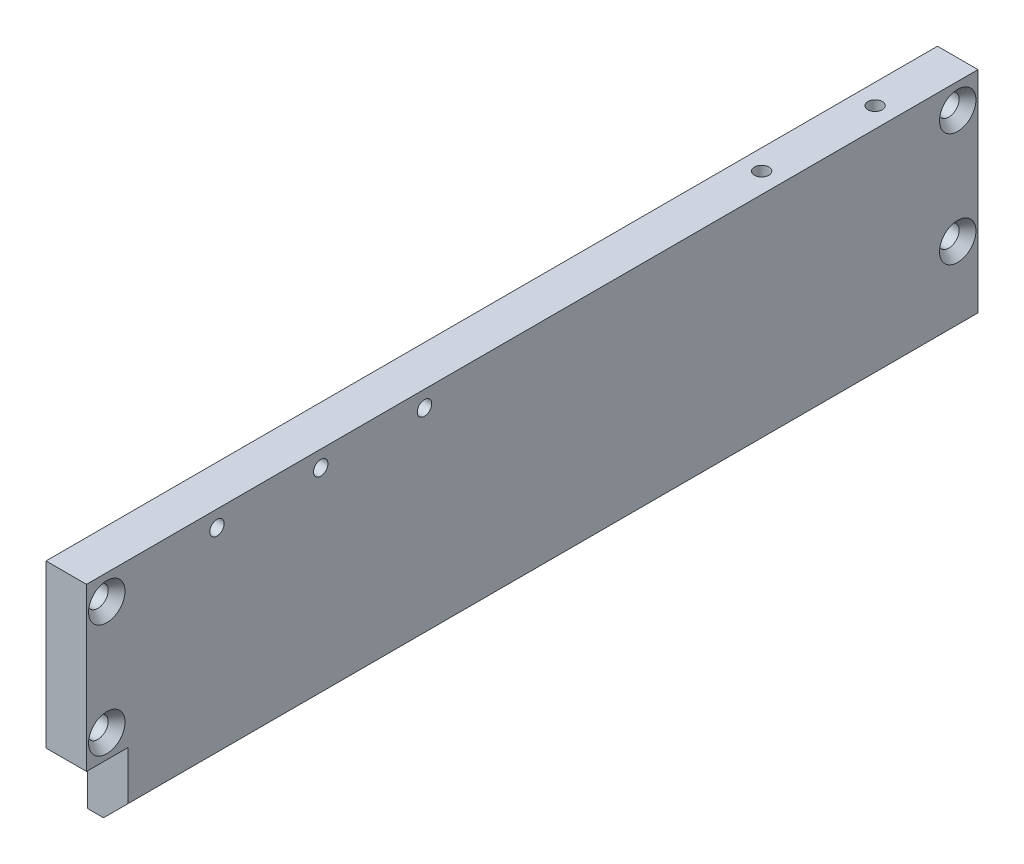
from build123d import *

# Parameters (mm, degrees)
SKETCH1_W                                      = 139.7
SKETCH1_H                                      = 36.83
EXTRUDE1_DEPTH                                 = 6.35
CSK_FOR_4_FLAT_HEAD_MACHINE_SCREW1_D           = 3.2639
CSK_FOR_4_FLAT_HEAD_MACHINE_SCREW1_CSINK_D     = 5.715
CSK_FOR_4_FLAT_HEAD_MACHINE_SCREW1_CSINK_ANGLE = 82
F_4_40_TAPPED_HOLE1_D                          = 2.2606
F_4_40_TAPPED_HOLE1_DEPTH                      = 11.43
F_4_40_TAPPED_HOLE1_TIP                        = 0.679152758
F_4_40_TAPPED_HOLE1_ON_FACE_2_D                = 2.2606
F_4_40_TAPPED_HOLE1_ON_FACE_2_DEPTH            = 11.43
F_4_40_TAPPED_HOLE1_ON_FACE_2_TIP              = 0.679152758
SKETCH6_W                                      = 6.477
SKETCH6_H                                      = 11.43
EXTRUDE2_DEPTH                                 = 76.037549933
CHAMFER1_SIZE                                  = 3.81
F_4_40_TAPPED_HOLE3_D                          = 2.2606


with BuildPart() as part:
    # Sketch1 → Extrude1 (new body)
    with BuildSketch(Plane(origin=(0, 0, 0), x_dir=(0, 0, -1), z_dir=(1, 0, 0))):
        with Locations((0, 8.255)):
            Rectangle(SKETCH1_W, SKETCH1_H)
    extrude(amount=EXTRUDE1_DEPTH)

    # CSK for _4 Flat Head Machine Screw1 (through all)
    with Locations(Plane(origin=(6.35, 22.733, 66.675), x_dir=(0, 0, 1), z_dir=(1, 0, 0))):
        with Locations((0, 0), (0, 17.78), (-133.35, 0), (-133.35, 17.78)):
            CounterSinkHole(CSK_FOR_4_FLAT_HEAD_MACHINE_SCREW1_D / 2, CSK_FOR_4_FLAT_HEAD_MACHINE_SCREW1_CSINK_D / 2, counter_sink_angle=CSK_FOR_4_FLAT_HEAD_MACHINE_SCREW1_CSINK_ANGLE)

    # 4-40 Tapped Hole1
    with Locations(Plane(origin=(3.175, 26.67, -39.116), x_dir=(0, 0, 1), z_dir=(0, 1, 0))):
        with Locations((0, 0), (-17.78, 0)):
            Hole(F_4_40_TAPPED_HOLE1_D / 2, depth=F_4_40_TAPPED_HOLE1_DEPTH)
            with Locations((0, 0, -(F_4_40_TAPPED_HOLE1_DEPTH + F_4_40_TAPPED_HOLE1_TIP / 2))):  # 118° drill point
                Cone(0, F_4_40_TAPPED_HOLE1_D / 2, F_4_40_TAPPED_HOLE1_TIP, mode=Mode.SUBTRACT)

    # 4-40 Tapped Hole1 on face 2
    with Locations(Plane(origin=(-19.414882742, 102.4939869, 0), x_dir=(0, 0, 1), z_dir=(0, 1, 0))):
        with Locations((0, 0)):
            Hole(F_4_40_TAPPED_HOLE1_ON_FACE_2_D / 2, depth=F_4_40_TAPPED_HOLE1_ON_FACE_2_DEPTH)
            with Locations((0, 0, -(F_4_40_TAPPED_HOLE1_ON_FACE_2_DEPTH + F_4_40_TAPPED_HOLE1_ON_FACE_2_TIP / 2))):  # 118° drill point
                Cone(0, F_4_40_TAPPED_HOLE1_ON_FACE_2_D / 2, F_4_40_TAPPED_HOLE1_ON_FACE_2_TIP, mode=Mode.SUBTRACT)

    # Sketch6 → Extrude2 (cut, through all)
    with BuildSketch(Plane(origin=(6.35, 0, 0), x_dir=(0, 0, -1), z_dir=(1, 0, 0))):
        with Locations((-66.6115, -4.445)):
            Rectangle(SKETCH6_W, SKETCH6_H)
    extrude(amount=-EXTRUDE2_DEPTH, mode=Mode.SUBTRACT)

    # Chamfer1
    chamfer1_edges = [part.edges().sort_by_distance(p)[0] for p in [
        (6.35, -10.16, -3.2385),
    ]]
    chamfer(chamfer1_edges, length=CHAMFER1_SIZE)

    # 4-40 Tapped Hole3 (through all)
    with Locations(Plane(origin=(0, 24.13, 49.403), x_dir=(0, 0, -1), z_dir=(-1, 0, 0))):
        with Locations((0, 0), (16.256, 0), (32.512, 0), (0, 31.75), (16.256, 31.75), (32.512, 31.75)):
            Hole(F_4_40_TAPPED_HOLE3_D / 2)


solid = part.part
